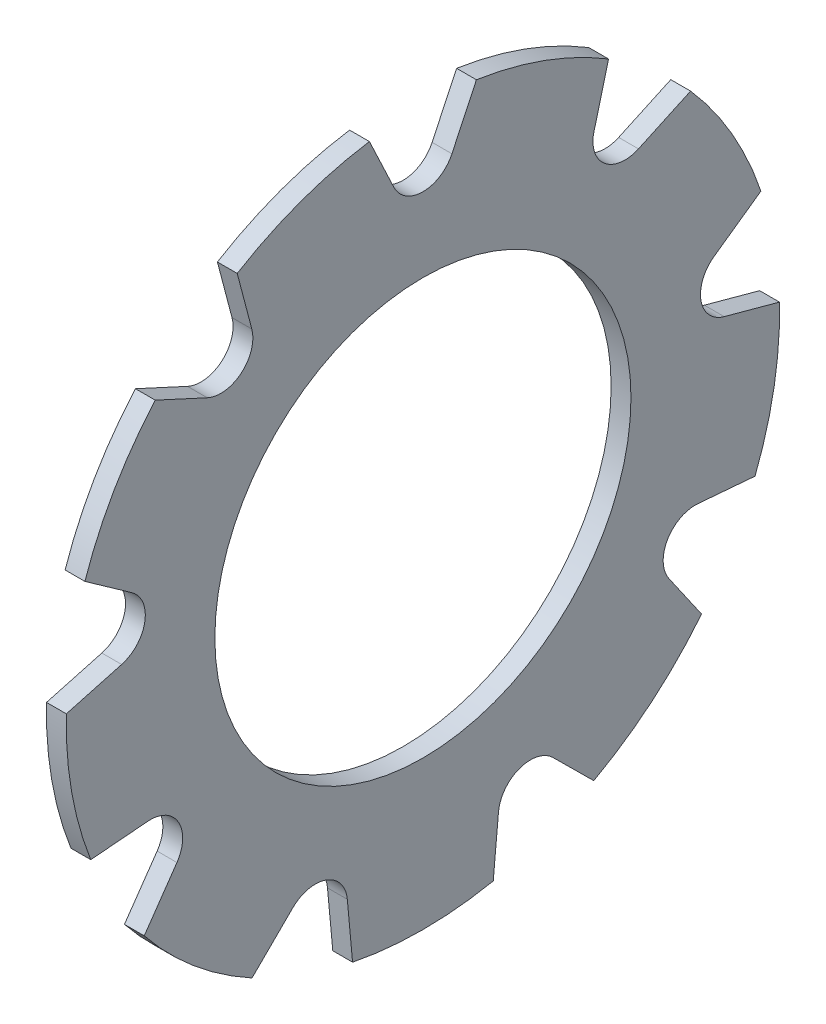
from build123d import *

# Parameters (mm, degrees)
SKETCH1_R          = 9
SKETCH1_R_2        = 5.25
BASE_EXTRUDE_DEPTH = 0.5
TYPEASLOT_DEPTH    = 13.737739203
TYPEAPATTERN_COUNT = 9


with BuildPart() as part:
    # Sketch1 → Base-Extrude (new body)
    with BuildSketch(Plane(origin=(0, 0, 0), x_dir=(0, 0, -1), z_dir=(1, 0, 0))):
        Circle(SKETCH1_R)
        Circle(SKETCH1_R_2, mode=Mode.SUBTRACT)
    extrude(amount=-BASE_EXTRUDE_DEPTH)

    # Sketch3 → TypeASlot (cut, through all)
    with BuildSketch(Plane(origin=(0, 0, 0), x_dir=(0, 0, -1), z_dir=(1, 0, 0))):
        with BuildLine():
            Line((0.732571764, 7.589401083), (1.35, 8.89817397))
            Line((1.35, 8.89817397), (1.35, 9.70817397))
            Line((1.35, 9.70817397), (-1.35, 9.70817397))
            Line((-1.35, 9.70817397), (-1.35, 8.89817397))
            Line((-1.35, 8.89817397), (-0.732571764, 7.589401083))
            ThreePointArc((-0.732571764, 7.589401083), (0, 7.125), (0.732571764, 7.589401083))
        make_face()
    typeaslot = extrude(amount=-TYPEASLOT_DEPTH, mode=Mode.SUBTRACT)

    # TypeAPattern: TypeASlot ×9 about axis
    typeapattern_axis = Axis((0, 0, 0), (1, 0, 0))
    for i in range(1, TYPEAPATTERN_COUNT):
        add(typeaslot.rotate(typeapattern_axis, i * 360 / TYPEAPATTERN_COUNT), mode=Mode.SUBTRACT)


solid = part.part
